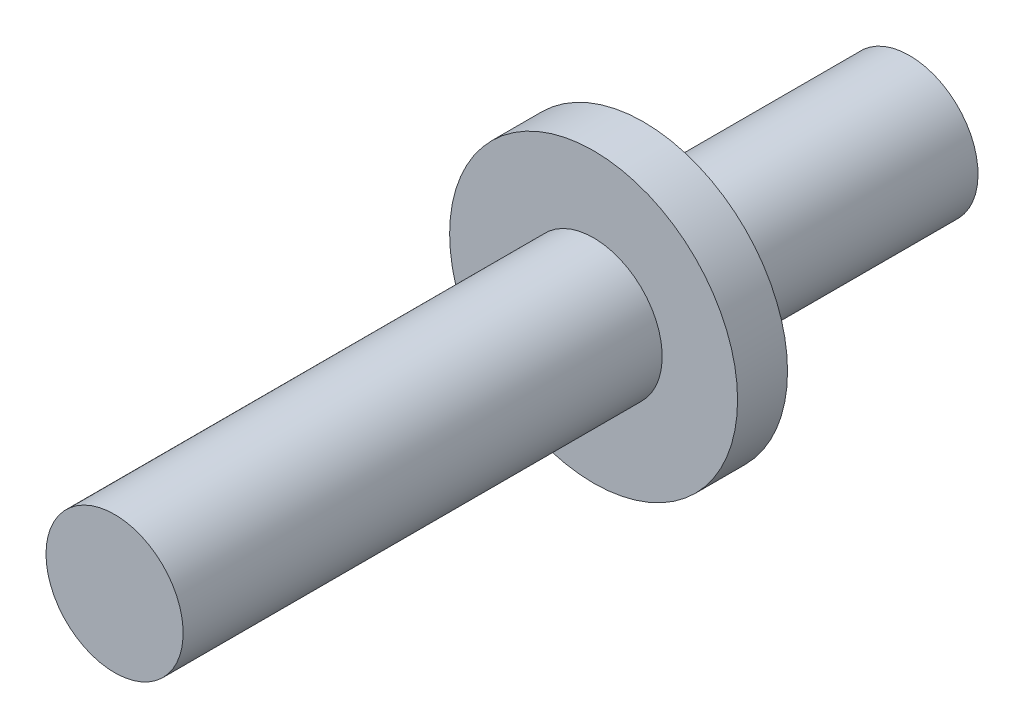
from build123d import *

# Parameters (mm, degrees)
SKETCH2_R      = 4.7625
EXTRUDE1_DEPTH = 33.273094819
SKETCH3_R      = 10
EXTRUDE2_DEPTH = 3.46937277
EXTRUDE3_START = 18.46937277
SKETCH4_R      = 4.7625
EXTRUDE3_DEPTH = 18.46937277


with BuildPart() as part:
    # Sketch2 → Extrude1 (new body)
    with BuildSketch(Plane(origin=(0, 0, 0), x_dir=(-1, 0, 0), z_dir=(0, 0, -1))):
        Circle(SKETCH2_R)
    extrude(amount=-EXTRUDE1_DEPTH)

    # Sketch3 → Extrude2 (add)
    with BuildSketch(Plane(origin=(0, 0, 0), x_dir=(-1, 0, 0), z_dir=(0, 0, -1))):
        Circle(SKETCH3_R)
    extrude(amount=EXTRUDE2_DEPTH)

    # Sketch4 → Extrude3 (add)
    with BuildSketch(Plane(origin=(0, 0, -3.46937277), x_dir=(-1, 0, 0), z_dir=(0, 0, -1)).offset(EXTRUDE3_START)):
        Circle(SKETCH4_R)
    extrude(amount=-EXTRUDE3_DEPTH)


solid = part.part
